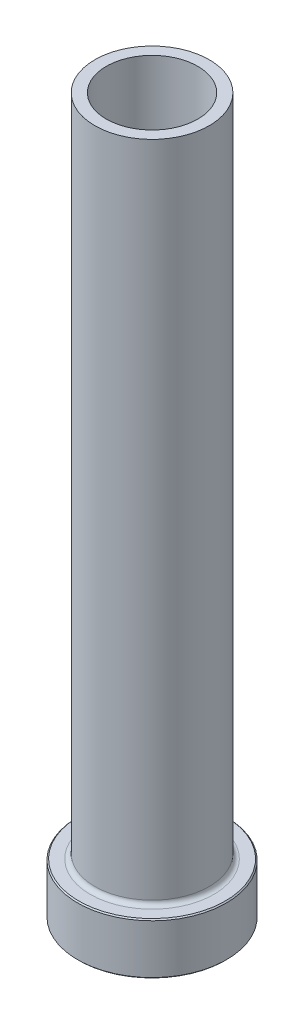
ISO-10303-21;
HEADER;
FILE_DESCRIPTION(('STEP AP214'),'2;1');
FILE_NAME('part.step','',(''),(''),'','','');
FILE_SCHEMA(('AUTOMOTIVE_DESIGN { 1 0 10303 214 1 1 1 1 }'));
ENDSEC;
DATA;
#1=APPLICATION_CONTEXT('core data for automotive mechanical design processes');
#2=APPLICATION_PROTOCOL_DEFINITION('international standard','automotive_design',2000,#1);
#3=PRODUCT_CONTEXT('',#1,'mechanical');
#4=PRODUCT('Part','Part','',(#3));
#5=PRODUCT_RELATED_PRODUCT_CATEGORY('part','',(#4));
#6=PRODUCT_DEFINITION_FORMATION('','',#4);
#7=PRODUCT_DEFINITION_CONTEXT('part definition',#1,'design');
#8=PRODUCT_DEFINITION('design','',#6,#7);
#9=PRODUCT_DEFINITION_SHAPE('','',#8);
#10=(LENGTH_UNIT() NAMED_UNIT(*) SI_UNIT(.MILLI.,.METRE.));
#11=(NAMED_UNIT(*) PLANE_ANGLE_UNIT() SI_UNIT($,.RADIAN.));
#12=(NAMED_UNIT(*) SI_UNIT($,.STERADIAN.) SOLID_ANGLE_UNIT());
#13=UNCERTAINTY_MEASURE_WITH_UNIT(LENGTH_MEASURE(1.E-05),#10,'distance_accuracy_value','');
#14=(GEOMETRIC_REPRESENTATION_CONTEXT(3) GLOBAL_UNCERTAINTY_ASSIGNED_CONTEXT((#13)) GLOBAL_UNIT_ASSIGNED_CONTEXT((#10,
#11,#12)) REPRESENTATION_CONTEXT('',''));
#15=CARTESIAN_POINT('',(0.,0.,0.));
#16=DIRECTION('',(0.,0.,1.));
#17=DIRECTION('',(1.,0.,0.));
#18=AXIS2_PLACEMENT_3D('',#15,#16,#17);
#19=CARTESIAN_POINT('',(0.,92.1876809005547,0.));
#20=DIRECTION('',(0.,1.,0.));
#21=DIRECTION('',(0.,0.,1.));
#22=AXIS2_PLACEMENT_3D('',#19,#20,#21);
#23=CYLINDRICAL_SURFACE('',#22,7.99999999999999);
#24=CARTESIAN_POINT('',(0.,125.,0.));
#25=DIRECTION('',(0.,1.,0.));
#26=DIRECTION('',(0.,0.,1.));
#27=AXIS2_PLACEMENT_3D('',#24,#25,#26);
#28=CIRCLE('',#27,7.99999999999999);
#29=CARTESIAN_POINT('',(0.,125.,7.99999999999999));
#30=VERTEX_POINT('',#29);
#31=EDGE_CURVE('E62',#30,#30,#28,.T.);
#32=ORIENTED_EDGE('',*,*,#31,.T.);
#33=EDGE_LOOP('',(#32));
#34=FACE_BOUND('',#33,.T.);
#35=CARTESIAN_POINT('',(0.,70.,0.));
#36=DIRECTION('',(0.,1.,0.));
#37=DIRECTION('',(0.,0.,1.));
#38=AXIS2_PLACEMENT_3D('',#35,#36,#37);
#39=CIRCLE('',#38,7.99999999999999);
#40=CARTESIAN_POINT('',(0.,70.,7.99999999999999));
#41=VERTEX_POINT('',#40);
#42=EDGE_CURVE('E71',#41,#41,#39,.T.);
#43=ORIENTED_EDGE('',*,*,#42,.F.);
#44=EDGE_LOOP('',(#43));
#45=FACE_BOUND('',#44,.T.);
#46=ADVANCED_FACE('F30',(#34,#45),#23,.F.);
#47=CARTESIAN_POINT('',(-7.99999999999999,125.,0.));
#48=DIRECTION('',(0.,1.,0.));
#49=DIRECTION('',(0.,0.,1.));
#50=AXIS2_PLACEMENT_3D('',#47,#48,#49);
#51=PLANE('',#50);
#52=CARTESIAN_POINT('',(0.,125.,0.));
#53=DIRECTION('',(0.,1.,0.));
#54=DIRECTION('',(0.,0.,1.));
#55=AXIS2_PLACEMENT_3D('',#52,#53,#54);
#56=CIRCLE('',#55,10.);
#57=CARTESIAN_POINT('',(0.,125.,10.));
#58=VERTEX_POINT('',#57);
#59=EDGE_CURVE('E65',#58,#58,#56,.T.);
#60=ORIENTED_EDGE('',*,*,#59,.T.);
#61=EDGE_LOOP('',(#60));
#62=FACE_BOUND('',#61,.T.);
#63=ORIENTED_EDGE('',*,*,#31,.F.);
#64=EDGE_LOOP('',(#63));
#65=FACE_BOUND('',#64,.T.);
#66=ADVANCED_FACE('F79',(#62,#65),#51,.T.);
#67=CARTESIAN_POINT('',(0.,92.1876809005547,0.));
#68=DIRECTION('',(0.,1.,0.));
#69=DIRECTION('',(0.,0.,1.));
#70=AXIS2_PLACEMENT_3D('',#67,#68,#69);
#71=CYLINDRICAL_SURFACE('',#70,10.);
#72=CARTESIAN_POINT('',(0.,9.8,0.));
#73=DIRECTION('',(0.,1.,0.));
#74=DIRECTION('',(0.,0.,1.));
#75=AXIS2_PLACEMENT_3D('',#72,#73,#74);
#76=CIRCLE('',#75,10.);
#77=CARTESIAN_POINT('',(0.,9.8,10.));
#78=VERTEX_POINT('',#77);
#79=EDGE_CURVE('E59',#78,#78,#76,.T.);
#80=ORIENTED_EDGE('',*,*,#79,.T.);
#81=EDGE_LOOP('',(#80));
#82=FACE_BOUND('',#81,.T.);
#83=ORIENTED_EDGE('',*,*,#59,.F.);
#84=EDGE_LOOP('',(#83));
#85=FACE_BOUND('',#84,.T.);
#86=ADVANCED_FACE('F85',(#82,#85),#71,.T.);
#87=CARTESIAN_POINT('',(-9.99999999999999,9.,0.));
#88=DIRECTION('',(0.,1.,0.));
#89=DIRECTION('',(0.,0.,1.));
#90=AXIS2_PLACEMENT_3D('',#87,#88,#89);
#91=PLANE('',#90);
#92=CARTESIAN_POINT('',(0.,9.,0.));
#93=DIRECTION('',(0.,1.,0.));
#94=DIRECTION('',(0.,0.,1.));
#95=AXIS2_PLACEMENT_3D('',#92,#93,#94);
#96=CIRCLE('',#95,12.8);
#97=CARTESIAN_POINT('',(0.,9.,-12.8));
#98=VERTEX_POINT('',#97);
#99=EDGE_CURVE('E53',#98,#98,#96,.T.);
#100=ORIENTED_EDGE('',*,*,#99,.T.);
#101=EDGE_LOOP('',(#100));
#102=FACE_BOUND('',#101,.T.);
#103=CARTESIAN_POINT('',(0.,9.,0.));
#104=DIRECTION('',(0.,1.,0.));
#105=DIRECTION('',(0.,0.,1.));
#106=AXIS2_PLACEMENT_3D('',#103,#104,#105);
#107=CIRCLE('',#106,10.8);
#108=CARTESIAN_POINT('',(0.,9.,10.8));
#109=VERTEX_POINT('',#108);
#110=EDGE_CURVE('E56',#109,#109,#107,.F.);
#111=ORIENTED_EDGE('',*,*,#110,.T.);
#112=EDGE_LOOP('',(#111));
#113=FACE_BOUND('',#112,.T.);
#114=ADVANCED_FACE('F111',(#102,#113),#91,.T.);
#115=CARTESIAN_POINT('',(0.,92.1876809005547,0.));
#116=DIRECTION('',(0.,1.,0.));
#117=DIRECTION('',(0.,0.,1.));
#118=AXIS2_PLACEMENT_3D('',#115,#116,#117);
#119=CYLINDRICAL_SURFACE('',#118,13.);
#120=CARTESIAN_POINT('',(0.,8.80000000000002,0.));
#121=DIRECTION('',(0.,1.,0.));
#122=DIRECTION('',(0.,0.,1.));
#123=AXIS2_PLACEMENT_3D('',#120,#121,#122);
#124=CIRCLE('',#123,13.);
#125=CARTESIAN_POINT('',(0.,8.80000000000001,-13.));
#126=VERTEX_POINT('',#125);
#127=EDGE_CURVE('E45',#126,#126,#124,.F.);
#128=ORIENTED_EDGE('',*,*,#127,.T.);
#129=EDGE_LOOP('',(#128));
#130=FACE_BOUND('',#129,.T.);
#131=CARTESIAN_POINT('',(0.,0.199999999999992,0.));
#132=DIRECTION('',(0.,-1.,0.));
#133=DIRECTION('',(0.,0.,-1.));
#134=AXIS2_PLACEMENT_3D('',#131,#132,#133);
#135=CIRCLE('',#134,13.);
#136=CARTESIAN_POINT('',(0.,0.199999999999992,-13.));
#137=VERTEX_POINT('',#136);
#138=EDGE_CURVE('E50',#137,#137,#135,.F.);
#139=ORIENTED_EDGE('',*,*,#138,.T.);
#140=EDGE_LOOP('',(#139));
#141=FACE_BOUND('',#140,.T.);
#142=ADVANCED_FACE('F108',(#130,#141),#119,.T.);
#143=CARTESIAN_POINT('',(-13.,0.,0.));
#144=DIRECTION('',(0.,-1.,0.));
#145=DIRECTION('',(0.,0.,-1.));
#146=AXIS2_PLACEMENT_3D('',#143,#144,#145);
#147=PLANE('',#146);
#148=CARTESIAN_POINT('',(0.,0.,0.));
#149=DIRECTION('',(0.,-1.,0.));
#150=DIRECTION('',(0.,0.,-1.));
#151=AXIS2_PLACEMENT_3D('',#148,#149,#150);
#152=CIRCLE('',#151,8.74999999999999);
#153=CARTESIAN_POINT('',(0.,0.,-8.74999999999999));
#154=VERTEX_POINT('',#153);
#155=EDGE_CURVE('E37',#154,#154,#152,.F.);
#156=ORIENTED_EDGE('',*,*,#155,.T.);
#157=EDGE_LOOP('',(#156));
#158=FACE_BOUND('',#157,.T.);
#159=CARTESIAN_POINT('',(0.,0.,0.));
#160=DIRECTION('',(0.,-1.,0.));
#161=DIRECTION('',(0.,0.,-1.));
#162=AXIS2_PLACEMENT_3D('',#159,#160,#161);
#163=CIRCLE('',#162,12.8);
#164=CARTESIAN_POINT('',(0.,0.,-12.8));
#165=VERTEX_POINT('',#164);
#166=EDGE_CURVE('E41',#165,#165,#163,.T.);
#167=ORIENTED_EDGE('',*,*,#166,.T.);
#168=EDGE_LOOP('',(#167));
#169=FACE_BOUND('',#168,.T.);
#170=ADVANCED_FACE('F110',(#158,#169),#147,.T.);
#171=CARTESIAN_POINT('',(0.,92.1876809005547,0.));
#172=DIRECTION('',(0.,1.,0.));
#173=DIRECTION('',(0.,0.,1.));
#174=AXIS2_PLACEMENT_3D('',#171,#172,#173);
#175=CYLINDRICAL_SURFACE('',#174,8.24999999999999);
#176=CARTESIAN_POINT('',(0.,0.500000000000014,0.));
#177=DIRECTION('',(0.,-1.,0.));
#178=DIRECTION('',(0.,0.,-1.));
#179=AXIS2_PLACEMENT_3D('',#176,#177,#178);
#180=CIRCLE('',#179,8.24999999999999);
#181=CARTESIAN_POINT('',(0.,0.500000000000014,-8.24999999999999));
#182=VERTEX_POINT('',#181);
#183=EDGE_CURVE('E10',#182,#182,#180,.T.);
#184=ORIENTED_EDGE('',*,*,#183,.T.);
#185=EDGE_LOOP('',(#184));
#186=FACE_BOUND('',#185,.T.);
#187=CARTESIAN_POINT('',(0.,58.,0.));
#188=DIRECTION('',(0.,1.,0.));
#189=DIRECTION('',(0.,0.,1.));
#190=AXIS2_PLACEMENT_3D('',#187,#188,#189);
#191=CIRCLE('',#190,8.25);
#192=CARTESIAN_POINT('',(0.,58.,8.25));
#193=VERTEX_POINT('',#192);
#194=EDGE_CURVE('E68',#193,#193,#191,.T.);
#195=ORIENTED_EDGE('',*,*,#194,.T.);
#196=EDGE_LOOP('',(#195));
#197=FACE_BOUND('',#196,.T.);
#198=ADVANCED_FACE('F118',(#186,#197),#175,.F.);
#199=CARTESIAN_POINT('',(0.,58.,0.));
#200=DIRECTION('',(0.,-1.,0.));
#201=DIRECTION('',(0.,0.,-1.));
#202=AXIS2_PLACEMENT_3D('',#199,#200,#201);
#203=CONICAL_SURFACE('',#202,8.25,0.0208303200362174);
#204=ORIENTED_EDGE('',*,*,#42,.T.);
#205=EDGE_LOOP('',(#204));
#206=FACE_BOUND('',#205,.T.);
#207=ORIENTED_EDGE('',*,*,#194,.F.);
#208=EDGE_LOOP('',(#207));
#209=FACE_BOUND('',#208,.T.);
#210=ADVANCED_FACE('F75',(#206,#209),#203,.F.);
#211=CARTESIAN_POINT('',(0.,9.8,0.));
#212=DIRECTION('',(0.,1.,0.));
#213=DIRECTION('',(0.,0.,1.));
#214=AXIS2_PLACEMENT_3D('',#211,#212,#213);
#215=TOROIDAL_SURFACE('',#214,10.8,0.8);
#216=ORIENTED_EDGE('',*,*,#110,.F.);
#217=EDGE_LOOP('',(#216));
#218=FACE_BOUND('',#217,.T.);
#219=ORIENTED_EDGE('',*,*,#79,.F.);
#220=EDGE_LOOP('',(#219));
#221=FACE_BOUND('',#220,.T.);
#222=ADVANCED_FACE('F90',(#218,#221),#215,.F.);
#223=CARTESIAN_POINT('',(0.,8.99999999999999,0.));
#224=DIRECTION('',(0.,-1.,0.));
#225=DIRECTION('',(0.,0.,-1.));
#226=AXIS2_PLACEMENT_3D('',#223,#224,#225);
#227=CONICAL_SURFACE('',#226,12.8,0.785398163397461);
#228=CARTESIAN_POINT('',(0.,8.80000000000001,-13.));
#229=CARTESIAN_POINT('',(0.,8.80208333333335,-12.9979166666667));
#230=CARTESIAN_POINT('',(0.,8.80416666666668,-12.9958333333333));
#231=CARTESIAN_POINT('',(0.,8.80833333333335,-12.9916666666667));
#232=CARTESIAN_POINT('',(0.,8.81041666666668,-12.9895833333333));
#233=CARTESIAN_POINT('',(0.,8.81458333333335,-12.9854166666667));
#234=CARTESIAN_POINT('',(0.,8.81666666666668,-12.9833333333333));
#235=CARTESIAN_POINT('',(0.,8.82083333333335,-12.9791666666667));
#236=CARTESIAN_POINT('',(0.,8.82291666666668,-12.9770833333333));
#237=CARTESIAN_POINT('',(0.,8.82708333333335,-12.9729166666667));
#238=CARTESIAN_POINT('',(0.,8.82916666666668,-12.9708333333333));
#239=CARTESIAN_POINT('',(0.,8.83333333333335,-12.9666666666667));
#240=CARTESIAN_POINT('',(0.,8.83541666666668,-12.9645833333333));
#241=CARTESIAN_POINT('',(0.,8.83958333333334,-12.9604166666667));
#242=CARTESIAN_POINT('',(0.,8.84166666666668,-12.9583333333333));
#243=CARTESIAN_POINT('',(0.,8.84583333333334,-12.9541666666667));
#244=CARTESIAN_POINT('',(0.,8.84791666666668,-12.9520833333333));
#245=CARTESIAN_POINT('',(0.,8.85208333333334,-12.9479166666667));
#246=CARTESIAN_POINT('',(0.,8.85416666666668,-12.9458333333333));
#247=CARTESIAN_POINT('',(0.,8.85833333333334,-12.9416666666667));
#248=CARTESIAN_POINT('',(0.,8.86041666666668,-12.9395833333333));
#249=CARTESIAN_POINT('',(0.,8.86458333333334,-12.9354166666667));
#250=CARTESIAN_POINT('',(0.,8.86666666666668,-12.9333333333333));
#251=CARTESIAN_POINT('',(0.,8.87083333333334,-12.9291666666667));
#252=CARTESIAN_POINT('',(0.,8.87291666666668,-12.9270833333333));
#253=CARTESIAN_POINT('',(0.,8.87708333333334,-12.9229166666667));
#254=CARTESIAN_POINT('',(0.,8.87916666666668,-12.9208333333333));
#255=CARTESIAN_POINT('',(0.,8.88333333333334,-12.9166666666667));
#256=CARTESIAN_POINT('',(0.,8.88541666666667,-12.9145833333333));
#257=CARTESIAN_POINT('',(0.,8.88958333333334,-12.9104166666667));
#258=CARTESIAN_POINT('',(0.,8.89166666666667,-12.9083333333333));
#259=CARTESIAN_POINT('',(0.,8.89583333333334,-12.9041666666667));
#260=CARTESIAN_POINT('',(0.,8.89791666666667,-12.9020833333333));
#261=CARTESIAN_POINT('',(0.,8.90208333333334,-12.8979166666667));
#262=CARTESIAN_POINT('',(0.,8.90416666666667,-12.8958333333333));
#263=CARTESIAN_POINT('',(0.,8.90833333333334,-12.8916666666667));
#264=CARTESIAN_POINT('',(0.,8.91041666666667,-12.8895833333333));
#265=CARTESIAN_POINT('',(0.,8.91458333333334,-12.8854166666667));
#266=CARTESIAN_POINT('',(0.,8.91666666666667,-12.8833333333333));
#267=CARTESIAN_POINT('',(0.,8.92083333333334,-12.8791666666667));
#268=CARTESIAN_POINT('',(0.,8.92291666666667,-12.8770833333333));
#269=CARTESIAN_POINT('',(0.,8.92708333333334,-12.8729166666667));
#270=CARTESIAN_POINT('',(0.,8.92916666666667,-12.8708333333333));
#271=CARTESIAN_POINT('',(0.,8.93333333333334,-12.8666666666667));
#272=CARTESIAN_POINT('',(0.,8.93541666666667,-12.8645833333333));
#273=CARTESIAN_POINT('',(0.,8.93958333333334,-12.8604166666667));
#274=CARTESIAN_POINT('',(0.,8.94166666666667,-12.8583333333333));
#275=CARTESIAN_POINT('',(0.,8.94583333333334,-12.8541666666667));
#276=CARTESIAN_POINT('',(0.,8.94791666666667,-12.8520833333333));
#277=CARTESIAN_POINT('',(0.,8.95208333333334,-12.8479166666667));
#278=CARTESIAN_POINT('',(0.,8.95416666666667,-12.8458333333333));
#279=CARTESIAN_POINT('',(0.,8.95833333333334,-12.8416666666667));
#280=CARTESIAN_POINT('',(0.,8.96041666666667,-12.8395833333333));
#281=CARTESIAN_POINT('',(0.,8.96458333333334,-12.8354166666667));
#282=CARTESIAN_POINT('',(0.,8.96666666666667,-12.8333333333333));
#283=CARTESIAN_POINT('',(0.,8.97083333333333,-12.8291666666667));
#284=CARTESIAN_POINT('',(0.,8.97291666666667,-12.8270833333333));
#285=CARTESIAN_POINT('',(0.,8.97708333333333,-12.8229166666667));
#286=CARTESIAN_POINT('',(0.,8.97916666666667,-12.8208333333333));
#287=CARTESIAN_POINT('',(0.,8.98333333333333,-12.8166666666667));
#288=CARTESIAN_POINT('',(0.,8.98541666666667,-12.8145833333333));
#289=CARTESIAN_POINT('',(0.,8.98958333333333,-12.8104166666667));
#290=CARTESIAN_POINT('',(0.,8.99166666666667,-12.8083333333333));
#291=CARTESIAN_POINT('',(0.,8.99583333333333,-12.8041666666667));
#292=CARTESIAN_POINT('',(0.,8.99791666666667,-12.8020833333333));
#293=CARTESIAN_POINT('',(0.,9.,-12.8));
#294=B_SPLINE_CURVE_WITH_KNOTS('',3,(#228,#229,#230,#231,#232,#233,#234,#235,#236,#237,#238,
#239,#240,#241,#242,#243,#244,#245,#246,#247,#248,#249,#250,#251,#252,#253,#254,#255,#256,#257,
#258,#259,#260,#261,#262,#263,#264,#265,#266,#267,#268,#269,#270,#271,#272,#273,#274,#275,#276,
#277,#278,#279,#280,#281,#282,#283,#284,#285,#286,#287,#288,#289,#290,#291,#292,#293),
.UNSPECIFIED.,.F.,.F.,(4,2,2,2,2,2,2,2,2,2,2,2,2,2,2,2,2,2,2,2,2,2,2,2,2,2,2,2,2,2,2,2,4),(0.,
0.00883883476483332,0.0176776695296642,0.0265165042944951,0.0353553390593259,0.0441941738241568,
0.0530330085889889,0.0618718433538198,0.0707106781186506,0.0795495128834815,0.0883883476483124,
0.0972271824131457,0.106066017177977,0.114904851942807,0.123743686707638,0.132582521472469,
0.1414213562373,0.150260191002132,0.159099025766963,0.167937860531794,0.176776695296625,
0.185615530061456,0.194454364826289,0.20329319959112,0.212132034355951,0.220970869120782,
0.229809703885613,0.238648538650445,0.247487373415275,0.256326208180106,0.265165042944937,
0.274003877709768,0.2828427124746),.UNSPECIFIED.);
#295=EDGE_CURVE('BSEAM93',#126,#98,#294,.T.);
#296=ORIENTED_EDGE('',*,*,#127,.F.);
#297=ORIENTED_EDGE('',*,*,#99,.F.);
#298=ORIENTED_EDGE('',*,*,#295,.T.);
#299=ORIENTED_EDGE('',*,*,#295,.F.);
#300=EDGE_LOOP('',(#296,#298,#297,#299));
#301=FACE_BOUND('',#300,.T.);
#302=ADVANCED_FACE('F93',(#301),#227,.T.);
#303=CARTESIAN_POINT('',(0.,0.199999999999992,0.));
#304=DIRECTION('',(0.,1.,0.));
#305=DIRECTION('',(0.,0.,1.));
#306=AXIS2_PLACEMENT_3D('',#303,#304,#305);
#307=CONICAL_SURFACE('',#306,13.,0.785398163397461);
#308=ORIENTED_EDGE('',*,*,#166,.F.);
#309=EDGE_LOOP('',(#308));
#310=FACE_BOUND('',#309,.T.);
#311=ORIENTED_EDGE('',*,*,#138,.F.);
#312=EDGE_LOOP('',(#311));
#313=FACE_BOUND('',#312,.T.);
#314=ADVANCED_FACE('F96',(#310,#313),#307,.T.);
#315=CARTESIAN_POINT('',(0.,0.,0.));
#316=DIRECTION('',(0.,-1.,0.));
#317=DIRECTION('',(0.,0.,-1.));
#318=AXIS2_PLACEMENT_3D('',#315,#316,#317);
#319=CONICAL_SURFACE('',#318,8.74999999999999,0.785398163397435);
#320=ORIENTED_EDGE('',*,*,#183,.F.);
#321=EDGE_LOOP('',(#320));
#322=FACE_BOUND('',#321,.T.);
#323=ORIENTED_EDGE('',*,*,#155,.F.);
#324=EDGE_LOOP('',(#323));
#325=FACE_BOUND('',#324,.T.);
#326=ADVANCED_FACE('F32',(#322,#325),#319,.F.);
#327=CLOSED_SHELL('',(#46,#66,#86,#114,#142,#170,#198,#210,#222,#302,#314,#326));
#328=MANIFOLD_SOLID_BREP('B2',#327);
#329=ADVANCED_BREP_SHAPE_REPRESENTATION('',(#18,#328),#14);
#330=SHAPE_DEFINITION_REPRESENTATION(#9,#329);
ENDSEC;
END-ISO-10303-21;
